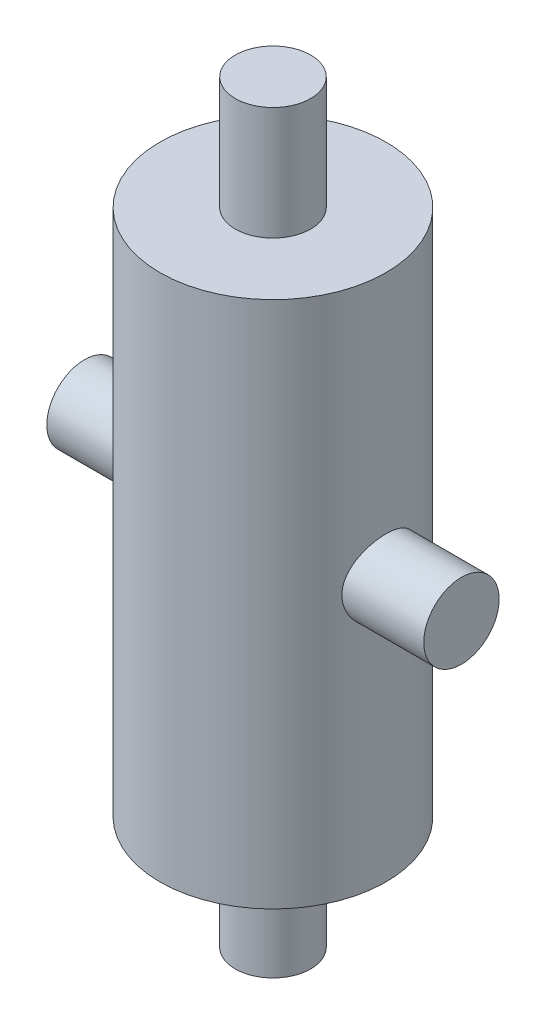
ISO-10303-21;
HEADER;
FILE_DESCRIPTION(('STEP AP214'),'2;1');
FILE_NAME('part.step','',(''),(''),'','','');
FILE_SCHEMA(('AUTOMOTIVE_DESIGN { 1 0 10303 214 1 1 1 1 }'));
ENDSEC;
DATA;
#1=APPLICATION_CONTEXT('core data for automotive mechanical design processes');
#2=APPLICATION_PROTOCOL_DEFINITION('international standard','automotive_design',2000,#1);
#3=PRODUCT_CONTEXT('',#1,'mechanical');
#4=PRODUCT('Part','Part','',(#3));
#5=PRODUCT_RELATED_PRODUCT_CATEGORY('part','',(#4));
#6=PRODUCT_DEFINITION_FORMATION('','',#4);
#7=PRODUCT_DEFINITION_CONTEXT('part definition',#1,'design');
#8=PRODUCT_DEFINITION('design','',#6,#7);
#9=PRODUCT_DEFINITION_SHAPE('','',#8);
#10=(LENGTH_UNIT() NAMED_UNIT(*) SI_UNIT(.MILLI.,.METRE.));
#11=(NAMED_UNIT(*) PLANE_ANGLE_UNIT() SI_UNIT($,.RADIAN.));
#12=(NAMED_UNIT(*) SI_UNIT($,.STERADIAN.) SOLID_ANGLE_UNIT());
#13=UNCERTAINTY_MEASURE_WITH_UNIT(LENGTH_MEASURE(1.E-05),#10,'distance_accuracy_value','');
#14=(GEOMETRIC_REPRESENTATION_CONTEXT(3) GLOBAL_UNCERTAINTY_ASSIGNED_CONTEXT((#13)) GLOBAL_UNIT_ASSIGNED_CONTEXT((#10,
#11,#12)) REPRESENTATION_CONTEXT('',''));
#15=CARTESIAN_POINT('',(0.,0.,0.));
#16=DIRECTION('',(0.,0.,1.));
#17=DIRECTION('',(1.,0.,0.));
#18=AXIS2_PLACEMENT_3D('',#15,#16,#17);
#19=CARTESIAN_POINT('',(0.,0.,0.));
#20=DIRECTION('',(0.,-1.,0.));
#21=DIRECTION('',(0.,0.,-1.));
#22=AXIS2_PLACEMENT_3D('',#19,#20,#21);
#23=PLANE('',#22);
#24=CARTESIAN_POINT('',(0.,0.,0.));
#25=DIRECTION('',(0.,1.,0.));
#26=DIRECTION('',(0.,0.,1.));
#27=AXIS2_PLACEMENT_3D('',#24,#25,#26);
#28=CIRCLE('',#27,5.);
#29=CARTESIAN_POINT('',(0.,0.,5.));
#30=VERTEX_POINT('',#29);
#31=EDGE_CURVE('E10',#30,#30,#28,.T.);
#32=ORIENTED_EDGE('',*,*,#31,.T.);
#33=EDGE_LOOP('',(#32));
#34=FACE_BOUND('',#33,.T.);
#35=ADVANCED_FACE('F32',(#34),#23,.F.);
#36=CARTESIAN_POINT('',(0.,27.7463943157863,0.));
#37=DIRECTION('',(0.,1.,0.));
#38=DIRECTION('',(0.,0.,1.));
#39=AXIS2_PLACEMENT_3D('',#36,#37,#38);
#40=CYLINDRICAL_SURFACE('',#39,5.);
#41=ORIENTED_EDGE('',*,*,#31,.F.);
#42=EDGE_LOOP('',(#41));
#43=FACE_BOUND('',#42,.T.);
#44=CARTESIAN_POINT('',(0.,-15.,0.));
#45=DIRECTION('',(0.,1.,0.));
#46=DIRECTION('',(0.,0.,1.));
#47=AXIS2_PLACEMENT_3D('',#44,#45,#46);
#48=CIRCLE('',#47,5.);
#49=CARTESIAN_POINT('',(0.,-15.,5.));
#50=VERTEX_POINT('',#49);
#51=EDGE_CURVE('E43',#50,#50,#48,.T.);
#52=ORIENTED_EDGE('',*,*,#51,.T.);
#53=EDGE_LOOP('',(#52));
#54=FACE_BOUND('',#53,.T.);
#55=ADVANCED_FACE('F89',(#43,#54),#40,.T.);
#56=CARTESIAN_POINT('',(5.,-15.,0.));
#57=DIRECTION('',(0.,-1.,0.));
#58=DIRECTION('',(0.,0.,-1.));
#59=AXIS2_PLACEMENT_3D('',#56,#57,#58);
#60=PLANE('',#59);
#61=ORIENTED_EDGE('',*,*,#51,.F.);
#62=EDGE_LOOP('',(#61));
#63=FACE_BOUND('',#62,.T.);
#64=CARTESIAN_POINT('',(0.,-15.,0.));
#65=DIRECTION('',(0.,1.,0.));
#66=DIRECTION('',(0.,0.,1.));
#67=AXIS2_PLACEMENT_3D('',#64,#65,#66);
#68=CIRCLE('',#67,15.);
#69=CARTESIAN_POINT('',(0.,-15.,15.));
#70=VERTEX_POINT('',#69);
#71=EDGE_CURVE('E48',#70,#70,#68,.T.);
#72=ORIENTED_EDGE('',*,*,#71,.T.);
#73=EDGE_LOOP('',(#72));
#74=FACE_BOUND('',#73,.T.);
#75=ADVANCED_FACE('F84',(#63,#74),#60,.F.);
#76=CARTESIAN_POINT('',(0.,27.7463943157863,0.));
#77=DIRECTION('',(0.,1.,0.));
#78=DIRECTION('',(0.,0.,1.));
#79=AXIS2_PLACEMENT_3D('',#76,#77,#78);
#80=CYLINDRICAL_SURFACE('',#79,15.);
#81=CARTESIAN_POINT('',(-14.142135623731,-50.,-5.));
#82=CARTESIAN_POINT('',(-14.1421347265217,-49.7276591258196,-5.00000128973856));
#83=CARTESIAN_POINT('',(-14.1500884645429,-49.455326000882,-4.97767391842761));
#84=CARTESIAN_POINT('',(-14.1808787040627,-48.9187278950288,-4.88925565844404));
#85=CARTESIAN_POINT('',(-14.2037176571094,-48.6544642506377,-4.82315756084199));
#86=CARTESIAN_POINT('',(-14.2614101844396,-48.1418655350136,-4.64977742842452));
#87=CARTESIAN_POINT('',(-14.2962401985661,-47.8935003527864,-4.54257610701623));
#88=CARTESIAN_POINT('',(-14.3739561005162,-47.4181997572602,-4.29030814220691));
#89=CARTESIAN_POINT('',(-14.4168437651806,-47.1912690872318,-4.14523314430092));
#90=CARTESIAN_POINT('',(-14.5077244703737,-46.7564001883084,-3.81525573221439));
#91=CARTESIAN_POINT('',(-14.5558447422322,-46.5494228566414,-3.6291217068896));
#92=CARTESIAN_POINT('',(-14.6506932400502,-46.1689659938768,-3.22493833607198));
#93=CARTESIAN_POINT('',(-14.6974212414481,-45.9954918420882,-3.00688387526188));
#94=CARTESIAN_POINT('',(-14.78569334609,-45.682605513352,-2.53802253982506));
#95=CARTESIAN_POINT('',(-14.8270703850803,-45.5442001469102,-2.28650955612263));
#96=CARTESIAN_POINT('',(-14.8984793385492,-45.3120420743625,-1.76215611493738));
#97=CARTESIAN_POINT('',(-14.9285143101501,-45.2182773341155,-1.48932142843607));
#98=CARTESIAN_POINT('',(-14.9729537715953,-45.081320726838,-0.940144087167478));
#99=CARTESIAN_POINT('',(-14.987865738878,-45.036482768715,-0.664253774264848));
#100=CARTESIAN_POINT('',(-15.0021804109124,-44.9934185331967,-0.108489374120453));
#101=CARTESIAN_POINT('',(-15.0015871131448,-44.9951802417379,0.171383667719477));
#102=CARTESIAN_POINT('',(-14.9853019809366,-45.0442212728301,0.715517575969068));
#103=CARTESIAN_POINT('',(-14.9702032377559,-45.0897126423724,0.979960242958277));
#104=CARTESIAN_POINT('',(-14.9273483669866,-45.2219649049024,1.49721719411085));
#105=CARTESIAN_POINT('',(-14.8995913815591,-45.3087285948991,1.75003068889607));
#106=CARTESIAN_POINT('',(-14.8337835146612,-45.5221065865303,2.24076237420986));
#107=CARTESIAN_POINT('',(-14.7956021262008,-45.6492296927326,2.47844110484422));
#108=CARTESIAN_POINT('',(-14.712919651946,-45.9392985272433,2.92962162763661));
#109=CARTESIAN_POINT('',(-14.6684168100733,-46.1022542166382,3.1431166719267));
#110=CARTESIAN_POINT('',(-14.5753095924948,-46.4683719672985,3.55050433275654));
#111=CARTESIAN_POINT('',(-14.5266107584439,-46.6730657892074,3.74300078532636));
#112=CARTESIAN_POINT('',(-14.432366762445,-47.1122436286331,4.09138629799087));
#113=CARTESIAN_POINT('',(-14.3868220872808,-47.3467322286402,4.24726971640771));
#114=CARTESIAN_POINT('',(-14.3035262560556,-47.8432681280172,4.51993727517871));
#115=CARTESIAN_POINT('',(-14.2658954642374,-48.1056606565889,4.6361323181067));
#116=CARTESIAN_POINT('',(-14.2040825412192,-48.6478569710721,4.82221596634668));
#117=CARTESIAN_POINT('',(-14.1798947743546,-48.9276534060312,4.89212397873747));
#118=CARTESIAN_POINT('',(-14.1489818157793,-49.4831917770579,4.98080641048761));
#119=CARTESIAN_POINT('',(-14.1415180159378,-49.7585471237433,5.00174547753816));
#120=CARTESIAN_POINT('',(-14.1428336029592,-50.3088807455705,4.9980271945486));
#121=CARTESIAN_POINT('',(-14.1516100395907,-50.58385908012,4.97337812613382));
#122=CARTESIAN_POINT('',(-14.183680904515,-51.1157848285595,4.88112825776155));
#123=CARTESIAN_POINT('',(-14.206466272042,-51.3730271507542,4.81503196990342));
#124=CARTESIAN_POINT('',(-14.2634276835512,-51.8727180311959,4.64356931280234));
#125=CARTESIAN_POINT('',(-14.297605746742,-52.1151639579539,4.53819598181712));
#126=CARTESIAN_POINT('',(-14.3748438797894,-52.586902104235,4.28737170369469));
#127=CARTESIAN_POINT('',(-14.4181512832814,-52.815533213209,4.14075559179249));
#128=CARTESIAN_POINT('',(-14.5082884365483,-53.2457302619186,3.8129281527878));
#129=CARTESIAN_POINT('',(-14.5551192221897,-53.4472881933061,3.63170662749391));
#130=CARTESIAN_POINT('',(-14.6497519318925,-53.8276399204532,3.22945852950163));
#131=CARTESIAN_POINT('',(-14.6974921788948,-54.0048719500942,3.00693635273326));
#132=CARTESIAN_POINT('',(-14.7863425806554,-54.3195807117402,2.53413645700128));
#133=CARTESIAN_POINT('',(-14.8274529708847,-54.4570588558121,2.28385972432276));
#134=CARTESIAN_POINT('',(-14.8982202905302,-54.6871005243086,1.76389931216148));
#135=CARTESIAN_POINT('',(-14.9279515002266,-54.7799563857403,1.49435561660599));
#136=CARTESIAN_POINT('',(-14.9729305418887,-54.9186387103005,0.942292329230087));
#137=CARTESIAN_POINT('',(-14.9881836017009,-54.9644821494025,0.659777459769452));
#138=CARTESIAN_POINT('',(-15.0020931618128,-55.0063103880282,0.10407667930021));
#139=CARTESIAN_POINT('',(-15.001496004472,-55.0045372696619,-0.168923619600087));
#140=CARTESIAN_POINT('',(-14.9856098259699,-54.956713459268,-0.710555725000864));
#141=CARTESIAN_POINT('',(-14.9703219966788,-54.9106663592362,-0.979187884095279));
#142=CARTESIAN_POINT('',(-14.9270457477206,-54.7770888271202,-1.50021059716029));
#143=CARTESIAN_POINT('',(-14.8992629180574,-54.6902289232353,-1.75279135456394));
#144=CARTESIAN_POINT('',(-14.8338580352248,-54.4781123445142,-2.23989175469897));
#145=CARTESIAN_POINT('',(-14.7962342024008,-54.3528487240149,-2.47440812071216));
#146=CARTESIAN_POINT('',(-14.7132934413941,-54.06215243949,-2.92817008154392));
#147=CARTESIAN_POINT('',(-14.6677436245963,-53.8954065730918,-3.14653125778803));
#148=CARTESIAN_POINT('',(-14.574649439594,-53.528713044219,-3.55290513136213));
#149=CARTESIAN_POINT('',(-14.5271044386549,-53.3287547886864,-3.74090810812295));
#150=CARTESIAN_POINT('',(-14.4331639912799,-52.8919532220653,-4.08870904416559));
#151=CARTESIAN_POINT('',(-14.3868863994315,-52.6539724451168,-4.2471148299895));
#152=CARTESIAN_POINT('',(-14.3030096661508,-52.1533278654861,-4.52157171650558));
#153=CARTESIAN_POINT('',(-14.2654082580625,-51.8906705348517,-4.63763388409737));
#154=CARTESIAN_POINT('',(-14.2050667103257,-51.3601908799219,-4.81921914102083));
#155=CARTESIAN_POINT('',(-14.1817316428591,-51.0931386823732,-4.88678954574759));
#156=CARTESIAN_POINT('',(-14.1502691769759,-50.5507197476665,-4.97717160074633));
#157=CARTESIAN_POINT('',(-14.1421365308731,-50.2753559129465,-4.99999869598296));
#158=CARTESIAN_POINT('',(-14.142135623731,-50.,-5.));
#159=B_SPLINE_CURVE_WITH_KNOTS('',3,(#81,#82,#83,#84,#85,#86,#87,#88,#89,#90,#91,#92,#93,#94,
#95,#96,#97,#98,#99,#100,#101,#102,#103,#104,#105,#106,#107,#108,#109,#110,#111,#112,#113,#114,
#115,#116,#117,#118,#119,#120,#121,#122,#123,#124,#125,#126,#127,#128,#129,#130,#131,#132,#133,
#134,#135,#136,#137,#138,#139,#140,#141,#142,#143,#144,#145,#146,#147,#148,#149,#150,#151,#152,
#153,#154,#155,#156,#157,#158),.UNSPECIFIED.,.T.,.F.,(4,2,2,2,2,2,2,2,2,2,2,2,2,2,2,2,2,2,2,2,2,
2,2,2,2,2,2,2,2,2,2,2,2,2,2,2,2,2,4),(0.,0.81600292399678,1.63214027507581,2.44668313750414,
3.26140583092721,4.1050668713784,4.94886325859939,5.81467530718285,6.68025381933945,
7.51571593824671,8.35096266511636,9.15345024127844,9.95599220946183,10.7690827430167,
11.5823995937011,12.4340087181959,13.2857489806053,14.1496319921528,15.0131525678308,
15.837714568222,16.6621267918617,17.4582197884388,18.2544539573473,19.0759428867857,
19.8976742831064,20.7589404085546,21.6201759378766,22.4756895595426,23.3308941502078,
24.1459042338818,24.960848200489,25.7628478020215,26.5649925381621,27.3967759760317,
28.2288252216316,29.0934451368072,29.9578389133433,30.7831606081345,31.6081973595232),.UNSPECIFIED.);
#160=CARTESIAN_POINT('',(-14.142135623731,-50.,-5.));
#161=VERTEX_POINT('',#160);
#162=EDGE_CURVE('E35',#161,#161,#159,.T.);
#163=ORIENTED_EDGE('',*,*,#162,.T.);
#164=EDGE_LOOP('',(#163));
#165=FACE_BOUND('',#164,.T.);
#166=CARTESIAN_POINT('',(14.142135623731,-50.,-5.));
#167=CARTESIAN_POINT('',(14.1421347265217,-50.2723408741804,-5.00000128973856));
#168=CARTESIAN_POINT('',(14.1500884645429,-50.544673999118,-4.97767391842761));
#169=CARTESIAN_POINT('',(14.1808787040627,-51.0812721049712,-4.88925565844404));
#170=CARTESIAN_POINT('',(14.2037176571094,-51.3455357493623,-4.82315756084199));
#171=CARTESIAN_POINT('',(14.2614101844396,-51.8581344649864,-4.64977742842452));
#172=CARTESIAN_POINT('',(14.2962401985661,-52.1064996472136,-4.54257610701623));
#173=CARTESIAN_POINT('',(14.3739561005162,-52.5818002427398,-4.29030814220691));
#174=CARTESIAN_POINT('',(14.4168437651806,-52.8087309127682,-4.14523314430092));
#175=CARTESIAN_POINT('',(14.5077244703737,-53.2435998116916,-3.81525573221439));
#176=CARTESIAN_POINT('',(14.5558447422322,-53.4505771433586,-3.6291217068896));
#177=CARTESIAN_POINT('',(14.6506932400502,-53.8310340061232,-3.22493833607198));
#178=CARTESIAN_POINT('',(14.6974212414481,-54.0045081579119,-3.00688387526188));
#179=CARTESIAN_POINT('',(14.78569334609,-54.317394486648,-2.53802253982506));
#180=CARTESIAN_POINT('',(14.8270703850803,-54.4557998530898,-2.28650955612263));
#181=CARTESIAN_POINT('',(14.8984793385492,-54.6879579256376,-1.76215611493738));
#182=CARTESIAN_POINT('',(14.9285143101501,-54.7817226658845,-1.48932142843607));
#183=CARTESIAN_POINT('',(14.9729537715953,-54.918679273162,-0.940144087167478));
#184=CARTESIAN_POINT('',(14.987865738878,-54.963517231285,-0.664253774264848));
#185=CARTESIAN_POINT('',(15.0021804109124,-55.0065814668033,-0.108489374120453));
#186=CARTESIAN_POINT('',(15.0015871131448,-55.0048197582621,0.171383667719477));
#187=CARTESIAN_POINT('',(14.9853019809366,-54.9557787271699,0.715517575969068));
#188=CARTESIAN_POINT('',(14.9702032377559,-54.9102873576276,0.979960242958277));
#189=CARTESIAN_POINT('',(14.9273483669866,-54.7780350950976,1.49721719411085));
#190=CARTESIAN_POINT('',(14.8995913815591,-54.6912714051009,1.75003068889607));
#191=CARTESIAN_POINT('',(14.8337835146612,-54.4778934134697,2.24076237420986));
#192=CARTESIAN_POINT('',(14.7956021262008,-54.3507703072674,2.47844110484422));
#193=CARTESIAN_POINT('',(14.712919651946,-54.0607014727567,2.92962162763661));
#194=CARTESIAN_POINT('',(14.6684168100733,-53.8977457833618,3.1431166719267));
#195=CARTESIAN_POINT('',(14.5753095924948,-53.5316280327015,3.55050433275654));
#196=CARTESIAN_POINT('',(14.5266107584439,-53.3269342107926,3.74300078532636));
#197=CARTESIAN_POINT('',(14.432366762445,-52.8877563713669,4.09138629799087));
#198=CARTESIAN_POINT('',(14.3868220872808,-52.6532677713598,4.24726971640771));
#199=CARTESIAN_POINT('',(14.3035262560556,-52.1567318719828,4.51993727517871));
#200=CARTESIAN_POINT('',(14.2658954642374,-51.8943393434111,4.6361323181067));
#201=CARTESIAN_POINT('',(14.2040825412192,-51.3521430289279,4.82221596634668));
#202=CARTESIAN_POINT('',(14.1798947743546,-51.0723465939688,4.89212397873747));
#203=CARTESIAN_POINT('',(14.1489818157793,-50.5168082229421,4.98080641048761));
#204=CARTESIAN_POINT('',(14.1415180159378,-50.2414528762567,5.00174547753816));
#205=CARTESIAN_POINT('',(14.1428336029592,-49.6911192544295,4.99802719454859));
#206=CARTESIAN_POINT('',(14.1516100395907,-49.4161409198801,4.97337812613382));
#207=CARTESIAN_POINT('',(14.183680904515,-48.8842151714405,4.88112825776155));
#208=CARTESIAN_POINT('',(14.206466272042,-48.6269728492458,4.81503196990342));
#209=CARTESIAN_POINT('',(14.2634276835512,-48.1272819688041,4.64356931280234));
#210=CARTESIAN_POINT('',(14.297605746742,-47.8848360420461,4.53819598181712));
#211=CARTESIAN_POINT('',(14.3748438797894,-47.413097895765,4.28737170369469));
#212=CARTESIAN_POINT('',(14.4181512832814,-47.184466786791,4.14075559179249));
#213=CARTESIAN_POINT('',(14.5082884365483,-46.7542697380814,3.8129281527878));
#214=CARTESIAN_POINT('',(14.5551192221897,-46.5527118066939,3.63170662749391));
#215=CARTESIAN_POINT('',(14.6497519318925,-46.1723600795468,3.22945852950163));
#216=CARTESIAN_POINT('',(14.6974921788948,-45.9951280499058,3.00693635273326));
#217=CARTESIAN_POINT('',(14.7863425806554,-45.6804192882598,2.53413645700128));
#218=CARTESIAN_POINT('',(14.8274529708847,-45.5429411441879,2.28385972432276));
#219=CARTESIAN_POINT('',(14.8982202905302,-45.3128994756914,1.76389931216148));
#220=CARTESIAN_POINT('',(14.9279515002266,-45.2200436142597,1.49435561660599));
#221=CARTESIAN_POINT('',(14.9729305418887,-45.0813612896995,0.942292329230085));
#222=CARTESIAN_POINT('',(14.9881836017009,-45.0355178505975,0.659777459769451));
#223=CARTESIAN_POINT('',(15.0020931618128,-44.9936896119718,0.10407667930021));
#224=CARTESIAN_POINT('',(15.001496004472,-44.9954627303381,-0.168923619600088));
#225=CARTESIAN_POINT('',(14.9856098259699,-45.043286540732,-0.710555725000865));
#226=CARTESIAN_POINT('',(14.9703219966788,-45.0893336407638,-0.979187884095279));
#227=CARTESIAN_POINT('',(14.9270457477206,-45.2229111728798,-1.50021059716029));
#228=CARTESIAN_POINT('',(14.8992629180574,-45.3097710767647,-1.75279135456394));
#229=CARTESIAN_POINT('',(14.8338580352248,-45.5218876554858,-2.23989175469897));
#230=CARTESIAN_POINT('',(14.7962342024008,-45.6471512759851,-2.47440812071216));
#231=CARTESIAN_POINT('',(14.7132934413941,-45.93784756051,-2.92817008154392));
#232=CARTESIAN_POINT('',(14.6677436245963,-46.1045934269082,-3.14653125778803));
#233=CARTESIAN_POINT('',(14.574649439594,-46.471286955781,-3.55290513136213));
#234=CARTESIAN_POINT('',(14.5271044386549,-46.6712452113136,-3.74090810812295));
#235=CARTESIAN_POINT('',(14.4331639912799,-47.1080467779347,-4.08870904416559));
#236=CARTESIAN_POINT('',(14.3868863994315,-47.3460275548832,-4.2471148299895));
#237=CARTESIAN_POINT('',(14.3030096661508,-47.8466721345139,-4.52157171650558));
#238=CARTESIAN_POINT('',(14.2654082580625,-48.1093294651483,-4.63763388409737));
#239=CARTESIAN_POINT('',(14.2050667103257,-48.6398091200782,-4.81921914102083));
#240=CARTESIAN_POINT('',(14.1817316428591,-48.9068613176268,-4.8867895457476));
#241=CARTESIAN_POINT('',(14.1502691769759,-49.4492802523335,-4.97717160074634));
#242=CARTESIAN_POINT('',(14.1421365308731,-49.7246440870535,-4.99999869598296));
#243=CARTESIAN_POINT('',(14.142135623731,-50.,-5.));
#244=B_SPLINE_CURVE_WITH_KNOTS('',3,(#166,#167,#168,#169,#170,#171,#172,#173,#174,#175,#176,
#177,#178,#179,#180,#181,#182,#183,#184,#185,#186,#187,#188,#189,#190,#191,#192,#193,#194,#195,
#196,#197,#198,#199,#200,#201,#202,#203,#204,#205,#206,#207,#208,#209,#210,#211,#212,#213,#214,
#215,#216,#217,#218,#219,#220,#221,#222,#223,#224,#225,#226,#227,#228,#229,#230,#231,#232,#233,
#234,#235,#236,#237,#238,#239,#240,#241,#242,#243),.UNSPECIFIED.,.T.,.F.,(4,2,2,2,2,2,2,2,2,2,2,
2,2,2,2,2,2,2,2,2,2,2,2,2,2,2,2,2,2,2,2,2,2,2,2,2,2,2,4),(0.,0.81600292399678,1.63214027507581,
2.44668313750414,3.26140583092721,4.1050668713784,4.94886325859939,5.81467530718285,
6.68025381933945,7.51571593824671,8.35096266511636,9.15345024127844,9.95599220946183,
10.7690827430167,11.5823995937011,12.4340087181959,13.2857489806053,14.1496319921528,
15.0131525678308,15.837714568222,16.6621267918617,17.4582197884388,18.2544539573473,
19.0759428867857,19.8976742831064,20.7589404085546,21.6201759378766,22.4756895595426,
23.3308941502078,24.1459042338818,24.960848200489,25.7628478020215,26.5649925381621,
27.3967759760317,28.2288252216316,29.0934451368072,29.9578389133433,30.7831606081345,
31.6081973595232),.UNSPECIFIED.);
#245=CARTESIAN_POINT('',(14.142135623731,-50.,-5.));
#246=VERTEX_POINT('',#245);
#247=EDGE_CURVE('E51',#246,#246,#244,.T.);
#248=ORIENTED_EDGE('',*,*,#247,.T.);
#249=EDGE_LOOP('',(#248));
#250=FACE_BOUND('',#249,.T.);
#251=ORIENTED_EDGE('',*,*,#71,.F.);
#252=EDGE_LOOP('',(#251));
#253=FACE_BOUND('',#252,.T.);
#254=CARTESIAN_POINT('',(0.,-85.,0.));
#255=DIRECTION('',(0.,1.,0.));
#256=DIRECTION('',(0.,0.,1.));
#257=AXIS2_PLACEMENT_3D('',#254,#255,#256);
#258=CIRCLE('',#257,15.);
#259=CARTESIAN_POINT('',(0.,-85.,15.));
#260=VERTEX_POINT('',#259);
#261=EDGE_CURVE('E104',#260,#260,#258,.T.);
#262=ORIENTED_EDGE('',*,*,#261,.T.);
#263=EDGE_LOOP('',(#262));
#264=FACE_BOUND('',#263,.T.);
#265=ADVANCED_FACE('F56',(#165,#250,#253,#264),#80,.T.);
#266=CARTESIAN_POINT('',(15.,-85.,0.));
#267=DIRECTION('',(0.,1.,0.));
#268=DIRECTION('',(0.,0.,1.));
#269=AXIS2_PLACEMENT_3D('',#266,#267,#268);
#270=PLANE('',#269);
#271=ORIENTED_EDGE('',*,*,#261,.F.);
#272=EDGE_LOOP('',(#271));
#273=FACE_BOUND('',#272,.T.);
#274=CARTESIAN_POINT('',(0.,-85.,0.));
#275=DIRECTION('',(0.,1.,0.));
#276=DIRECTION('',(0.,0.,1.));
#277=AXIS2_PLACEMENT_3D('',#274,#275,#276);
#278=CIRCLE('',#277,5.);
#279=CARTESIAN_POINT('',(0.,-85.,5.));
#280=VERTEX_POINT('',#279);
#281=EDGE_CURVE('E106',#280,#280,#278,.T.);
#282=ORIENTED_EDGE('',*,*,#281,.T.);
#283=EDGE_LOOP('',(#282));
#284=FACE_BOUND('',#283,.T.);
#285=ADVANCED_FACE('F77',(#273,#284),#270,.F.);
#286=CARTESIAN_POINT('',(0.,27.7463943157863,0.));
#287=DIRECTION('',(0.,1.,0.));
#288=DIRECTION('',(0.,0.,1.));
#289=AXIS2_PLACEMENT_3D('',#286,#287,#288);
#290=CYLINDRICAL_SURFACE('',#289,5.);
#291=ORIENTED_EDGE('',*,*,#281,.F.);
#292=EDGE_LOOP('',(#291));
#293=FACE_BOUND('',#292,.T.);
#294=CARTESIAN_POINT('',(0.,-100.,0.));
#295=DIRECTION('',(0.,1.,0.));
#296=DIRECTION('',(0.,0.,1.));
#297=AXIS2_PLACEMENT_3D('',#294,#295,#296);
#298=CIRCLE('',#297,5.);
#299=CARTESIAN_POINT('',(0.,-100.,5.));
#300=VERTEX_POINT('',#299);
#301=EDGE_CURVE('E111',#300,#300,#298,.T.);
#302=ORIENTED_EDGE('',*,*,#301,.T.);
#303=EDGE_LOOP('',(#302));
#304=FACE_BOUND('',#303,.T.);
#305=ADVANCED_FACE('F74',(#293,#304),#290,.T.);
#306=CARTESIAN_POINT('',(5.,-100.,0.));
#307=DIRECTION('',(0.,1.,0.));
#308=DIRECTION('',(0.,0.,1.));
#309=AXIS2_PLACEMENT_3D('',#306,#307,#308);
#310=PLANE('',#309);
#311=ORIENTED_EDGE('',*,*,#301,.F.);
#312=EDGE_LOOP('',(#311));
#313=FACE_BOUND('',#312,.T.);
#314=ADVANCED_FACE('F69',(#313),#310,.F.);
#315=CARTESIAN_POINT('',(25.,-50.,0.));
#316=DIRECTION('',(1.,0.,0.));
#317=DIRECTION('',(0.,0.,-1.));
#318=AXIS2_PLACEMENT_3D('',#315,#316,#317);
#319=PLANE('',#318);
#320=CARTESIAN_POINT('',(25.,-50.,0.));
#321=DIRECTION('',(1.,0.,0.));
#322=DIRECTION('',(0.,0.,-1.));
#323=AXIS2_PLACEMENT_3D('',#320,#321,#322);
#324=CIRCLE('',#323,5.);
#325=CARTESIAN_POINT('',(25.,-50.,-5.));
#326=VERTEX_POINT('',#325);
#327=EDGE_CURVE('E116',#326,#326,#324,.T.);
#328=ORIENTED_EDGE('',*,*,#327,.T.);
#329=EDGE_LOOP('',(#328));
#330=FACE_BOUND('',#329,.T.);
#331=ADVANCED_FACE('F73',(#330),#319,.T.);
#332=CARTESIAN_POINT('',(-25.,-50.,0.));
#333=DIRECTION('',(1.,0.,0.));
#334=DIRECTION('',(0.,0.,-1.));
#335=AXIS2_PLACEMENT_3D('',#332,#333,#334);
#336=CYLINDRICAL_SURFACE('',#335,5.);
#337=ORIENTED_EDGE('',*,*,#327,.F.);
#338=EDGE_LOOP('',(#337));
#339=FACE_BOUND('',#338,.T.);
#340=ORIENTED_EDGE('',*,*,#247,.F.);
#341=EDGE_LOOP('',(#340));
#342=FACE_BOUND('',#341,.T.);
#343=ADVANCED_FACE('F66',(#339,#342),#336,.T.);
#344=CARTESIAN_POINT('',(-25.,-50.,0.));
#345=DIRECTION('',(1.,0.,0.));
#346=DIRECTION('',(0.,0.,-1.));
#347=AXIS2_PLACEMENT_3D('',#344,#345,#346);
#348=CIRCLE('',#347,5.);
#349=CARTESIAN_POINT('',(-25.,-50.,-5.));
#350=VERTEX_POINT('',#349);
#351=EDGE_CURVE('E55',#350,#350,#348,.T.);
#352=ORIENTED_EDGE('',*,*,#351,.T.);
#353=EDGE_LOOP('',(#352));
#354=FACE_BOUND('',#353,.T.);
#355=ORIENTED_EDGE('',*,*,#162,.F.);
#356=EDGE_LOOP('',(#355));
#357=FACE_BOUND('',#356,.T.);
#358=ADVANCED_FACE('F60',(#354,#357),#336,.T.);
#359=CARTESIAN_POINT('',(-25.,-50.,0.));
#360=DIRECTION('',(1.,0.,0.));
#361=DIRECTION('',(0.,0.,-1.));
#362=AXIS2_PLACEMENT_3D('',#359,#360,#361);
#363=PLANE('',#362);
#364=ORIENTED_EDGE('',*,*,#351,.F.);
#365=EDGE_LOOP('',(#364));
#366=FACE_BOUND('',#365,.T.);
#367=ADVANCED_FACE('F65',(#366),#363,.F.);
#368=CLOSED_SHELL('',(#35,#55,#75,#265,#285,#305,#314,#331,#343,#358,#367));
#369=MANIFOLD_SOLID_BREP('B2',#368);
#370=ADVANCED_BREP_SHAPE_REPRESENTATION('',(#18,#369),#14);
#371=SHAPE_DEFINITION_REPRESENTATION(#9,#370);
ENDSEC;
END-ISO-10303-21;
